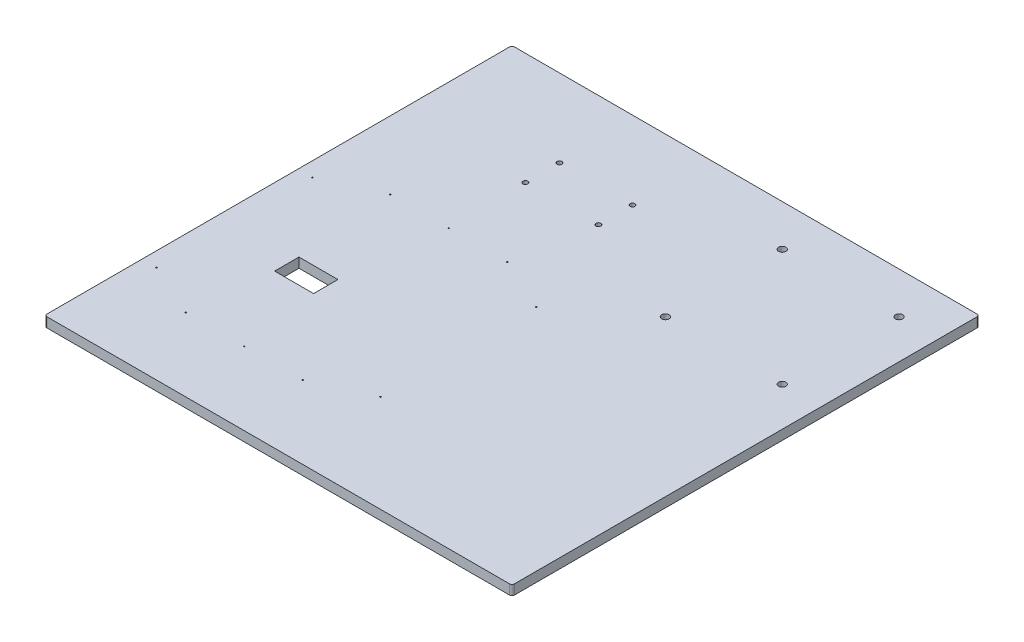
ISO-10303-21;
HEADER;
FILE_DESCRIPTION(('STEP AP214'),'2;1');
FILE_NAME('part.step','',(''),(''),'','','');
FILE_SCHEMA(('AUTOMOTIVE_DESIGN { 1 0 10303 214 1 1 1 1 }'));
ENDSEC;
DATA;
#1=APPLICATION_CONTEXT('core data for automotive mechanical design processes');
#2=APPLICATION_PROTOCOL_DEFINITION('international standard','automotive_design',2000,#1);
#3=PRODUCT_CONTEXT('',#1,'mechanical');
#4=PRODUCT('Part','Part','',(#3));
#5=PRODUCT_RELATED_PRODUCT_CATEGORY('part','',(#4));
#6=PRODUCT_DEFINITION_FORMATION('','',#4);
#7=PRODUCT_DEFINITION_CONTEXT('part definition',#1,'design');
#8=PRODUCT_DEFINITION('design','',#6,#7);
#9=PRODUCT_DEFINITION_SHAPE('','',#8);
#10=(LENGTH_UNIT() NAMED_UNIT(*) SI_UNIT(.MILLI.,.METRE.));
#11=(NAMED_UNIT(*) PLANE_ANGLE_UNIT() SI_UNIT($,.RADIAN.));
#12=(NAMED_UNIT(*) SI_UNIT($,.STERADIAN.) SOLID_ANGLE_UNIT());
#13=UNCERTAINTY_MEASURE_WITH_UNIT(LENGTH_MEASURE(1.E-05),#10,'distance_accuracy_value','');
#14=(GEOMETRIC_REPRESENTATION_CONTEXT(3) GLOBAL_UNCERTAINTY_ASSIGNED_CONTEXT((#13)) GLOBAL_UNIT_ASSIGNED_CONTEXT((#10,
#11,#12)) REPRESENTATION_CONTEXT('',''));
#15=CARTESIAN_POINT('',(0.,0.,0.));
#16=DIRECTION('',(0.,0.,1.));
#17=DIRECTION('',(1.,0.,0.));
#18=AXIS2_PLACEMENT_3D('',#15,#16,#17);
#19=CARTESIAN_POINT('',(0.,12.7,0.));
#20=DIRECTION('',(0.,-1.,0.));
#21=DIRECTION('',(0.,0.,-1.));
#22=AXIS2_PLACEMENT_3D('',#19,#20,#21);
#23=PLANE('',#22);
#24=CARTESIAN_POINT('',(258.7625,12.7,-463.55));
#25=DIRECTION('',(0.,1.,0.));
#26=DIRECTION('',(0.,0.,1.));
#27=AXIS2_PLACEMENT_3D('',#24,#25,#26);
#28=CIRCLE('',#27,3.17499999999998);
#29=CARTESIAN_POINT('',(258.7625,12.7,-460.375));
#30=VERTEX_POINT('',#29);
#31=EDGE_CURVE('E557',#30,#30,#28,.T.);
#32=ORIENTED_EDGE('',*,*,#31,.F.);
#33=EDGE_LOOP('',(#32));
#34=FACE_BOUND('',#33,.T.);
#35=CARTESIAN_POINT('',(163.5125,12.7,-463.55));
#36=DIRECTION('',(0.,1.,0.));
#37=DIRECTION('',(0.,0.,1.));
#38=AXIS2_PLACEMENT_3D('',#35,#36,#37);
#39=CIRCLE('',#38,3.17500000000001);
#40=CARTESIAN_POINT('',(163.5125,12.7,-460.375));
#41=VERTEX_POINT('',#40);
#42=EDGE_CURVE('E559',#41,#41,#39,.T.);
#43=ORIENTED_EDGE('',*,*,#42,.F.);
#44=EDGE_LOOP('',(#43));
#45=FACE_BOUND('',#44,.T.);
#46=CARTESIAN_POINT('',(163.5125,12.7,-508.));
#47=DIRECTION('',(0.,1.,0.));
#48=DIRECTION('',(0.,0.,1.));
#49=AXIS2_PLACEMENT_3D('',#46,#47,#48);
#50=CIRCLE('',#49,3.17500000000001);
#51=CARTESIAN_POINT('',(163.5125,12.7,-504.825));
#52=VERTEX_POINT('',#51);
#53=EDGE_CURVE('E567',#52,#52,#50,.T.);
#54=ORIENTED_EDGE('',*,*,#53,.F.);
#55=EDGE_LOOP('',(#54));
#56=FACE_BOUND('',#55,.T.);
#57=CARTESIAN_POINT('',(258.7625,12.7,-508.));
#58=DIRECTION('',(0.,1.,0.));
#59=DIRECTION('',(0.,0.,1.));
#60=AXIS2_PLACEMENT_3D('',#57,#58,#59);
#61=CIRCLE('',#60,3.17499999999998);
#62=CARTESIAN_POINT('',(258.7625,12.7,-504.825));
#63=VERTEX_POINT('',#62);
#64=EDGE_CURVE('E573',#63,#63,#61,.T.);
#65=ORIENTED_EDGE('',*,*,#64,.F.);
#66=EDGE_LOOP('',(#65));
#67=FACE_BOUND('',#66,.T.);
#68=CARTESIAN_POINT('',(558.8,12.7,-555.625));
#69=DIRECTION('',(0.,1.,0.));
#70=DIRECTION('',(0.,0.,1.));
#71=AXIS2_PLACEMENT_3D('',#68,#69,#70);
#72=CIRCLE('',#71,4.7625);
#73=CARTESIAN_POINT('',(558.8,12.7,-550.8625));
#74=VERTEX_POINT('',#73);
#75=EDGE_CURVE('E579',#74,#74,#72,.T.);
#76=ORIENTED_EDGE('',*,*,#75,.F.);
#77=EDGE_LOOP('',(#76));
#78=FACE_BOUND('',#77,.T.);
#79=CARTESIAN_POINT('',(558.8,12.7,-403.225));
#80=DIRECTION('',(0.,1.,0.));
#81=DIRECTION('',(0.,0.,1.));
#82=AXIS2_PLACEMENT_3D('',#79,#80,#81);
#83=CIRCLE('',#82,4.7625);
#84=CARTESIAN_POINT('',(558.8,12.7,-398.4625));
#85=VERTEX_POINT('',#84);
#86=EDGE_CURVE('E585',#85,#85,#83,.T.);
#87=ORIENTED_EDGE('',*,*,#86,.F.);
#88=EDGE_LOOP('',(#87));
#89=FACE_BOUND('',#88,.T.);
#90=CARTESIAN_POINT('',(406.4,12.7,-403.225));
#91=DIRECTION('',(0.,1.,0.));
#92=DIRECTION('',(0.,0.,1.));
#93=AXIS2_PLACEMENT_3D('',#90,#91,#92);
#94=CIRCLE('',#93,4.7625);
#95=CARTESIAN_POINT('',(406.4,12.7,-398.4625));
#96=VERTEX_POINT('',#95);
#97=EDGE_CURVE('E591',#96,#96,#94,.T.);
#98=ORIENTED_EDGE('',*,*,#97,.F.);
#99=EDGE_LOOP('',(#98));
#100=FACE_BOUND('',#99,.T.);
#101=CARTESIAN_POINT('',(406.4,12.7,-555.625));
#102=DIRECTION('',(0.,1.,0.));
#103=DIRECTION('',(0.,0.,1.));
#104=AXIS2_PLACEMENT_3D('',#101,#102,#103);
#105=CIRCLE('',#104,4.7625);
#106=CARTESIAN_POINT('',(406.4,12.7,-550.8625));
#107=VERTEX_POINT('',#106);
#108=EDGE_CURVE('E597',#107,#107,#105,.T.);
#109=ORIENTED_EDGE('',*,*,#108,.F.);
#110=EDGE_LOOP('',(#109));
#111=FACE_BOUND('',#110,.T.);
#112=CARTESIAN_POINT('',(88.9,12.7,-95.25));
#113=DIRECTION('',(0.,1.,0.));
#114=DIRECTION('',(0.,0.,1.));
#115=AXIS2_PLACEMENT_3D('',#112,#113,#114);
#116=CIRCLE('',#115,0.793749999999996);
#117=CARTESIAN_POINT('',(88.9,12.7,-94.45625));
#118=VERTEX_POINT('',#117);
#119=EDGE_CURVE('E603',#118,#118,#116,.T.);
#120=ORIENTED_EDGE('',*,*,#119,.F.);
#121=EDGE_LOOP('',(#120));
#122=FACE_BOUND('',#121,.T.);
#123=CARTESIAN_POINT('',(165.1,12.7,-95.25));
#124=DIRECTION('',(0.,1.,0.));
#125=DIRECTION('',(0.,0.,1.));
#126=AXIS2_PLACEMENT_3D('',#123,#124,#125);
#127=CIRCLE('',#126,0.79375000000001);
#128=CARTESIAN_POINT('',(165.1,12.7,-94.45625));
#129=VERTEX_POINT('',#128);
#130=EDGE_CURVE('E609',#129,#129,#127,.T.);
#131=ORIENTED_EDGE('',*,*,#130,.F.);
#132=EDGE_LOOP('',(#131));
#133=FACE_BOUND('',#132,.T.);
#134=CARTESIAN_POINT('',(241.3,12.7,-95.25));
#135=DIRECTION('',(0.,1.,0.));
#136=DIRECTION('',(0.,0.,1.));
#137=AXIS2_PLACEMENT_3D('',#134,#135,#136);
#138=CIRCLE('',#137,0.79375000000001);
#139=CARTESIAN_POINT('',(241.3,12.7,-94.45625));
#140=VERTEX_POINT('',#139);
#141=EDGE_CURVE('E615',#140,#140,#138,.T.);
#142=ORIENTED_EDGE('',*,*,#141,.F.);
#143=EDGE_LOOP('',(#142));
#144=FACE_BOUND('',#143,.T.);
#145=CARTESIAN_POINT('',(311.15,12.7,-127.));
#146=DIRECTION('',(0.,1.,0.));
#147=DIRECTION('',(0.,0.,1.));
#148=AXIS2_PLACEMENT_3D('',#145,#146,#147);
#149=CIRCLE('',#148,0.793749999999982);
#150=CARTESIAN_POINT('',(311.15,12.7,-126.20625));
#151=VERTEX_POINT('',#150);
#152=EDGE_CURVE('E621',#151,#151,#149,.T.);
#153=ORIENTED_EDGE('',*,*,#152,.F.);
#154=EDGE_LOOP('',(#153));
#155=FACE_BOUND('',#154,.T.);
#156=CARTESIAN_POINT('',(311.15,12.7,-330.2));
#157=DIRECTION('',(0.,1.,0.));
#158=DIRECTION('',(0.,0.,1.));
#159=AXIS2_PLACEMENT_3D('',#156,#157,#158);
#160=CIRCLE('',#159,0.793749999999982);
#161=CARTESIAN_POINT('',(311.15,12.7,-329.40625));
#162=VERTEX_POINT('',#161);
#163=EDGE_CURVE('E627',#162,#162,#160,.T.);
#164=ORIENTED_EDGE('',*,*,#163,.F.);
#165=EDGE_LOOP('',(#164));
#166=FACE_BOUND('',#165,.T.);
#167=CARTESIAN_POINT('',(241.3,12.7,-361.95));
#168=DIRECTION('',(0.,1.,0.));
#169=DIRECTION('',(0.,0.,1.));
#170=AXIS2_PLACEMENT_3D('',#167,#168,#169);
#171=CIRCLE('',#170,0.79375000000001);
#172=CARTESIAN_POINT('',(241.3,12.7,-361.15625));
#173=VERTEX_POINT('',#172);
#174=EDGE_CURVE('E633',#173,#173,#171,.T.);
#175=ORIENTED_EDGE('',*,*,#174,.F.);
#176=EDGE_LOOP('',(#175));
#177=FACE_BOUND('',#176,.T.);
#178=CARTESIAN_POINT('',(165.1,12.7,-361.95));
#179=DIRECTION('',(0.,1.,0.));
#180=DIRECTION('',(0.,0.,1.));
#181=AXIS2_PLACEMENT_3D('',#178,#179,#180);
#182=CIRCLE('',#181,0.79375000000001);
#183=CARTESIAN_POINT('',(165.1,12.7,-361.15625));
#184=VERTEX_POINT('',#183);
#185=EDGE_CURVE('E639',#184,#184,#182,.T.);
#186=ORIENTED_EDGE('',*,*,#185,.F.);
#187=EDGE_LOOP('',(#186));
#188=FACE_BOUND('',#187,.T.);
#189=CARTESIAN_POINT('',(88.9,12.7,-361.95));
#190=DIRECTION('',(0.,1.,0.));
#191=DIRECTION('',(0.,0.,1.));
#192=AXIS2_PLACEMENT_3D('',#189,#190,#191);
#193=CIRCLE('',#192,0.793749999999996);
#194=CARTESIAN_POINT('',(88.9,12.7,-361.15625));
#195=VERTEX_POINT('',#194);
#196=EDGE_CURVE('E645',#195,#195,#193,.T.);
#197=ORIENTED_EDGE('',*,*,#196,.F.);
#198=EDGE_LOOP('',(#197));
#199=FACE_BOUND('',#198,.T.);
#200=CARTESIAN_POINT('',(19.0499999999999,12.7,-330.2));
#201=DIRECTION('',(0.,1.,0.));
#202=DIRECTION('',(0.,0.,1.));
#203=AXIS2_PLACEMENT_3D('',#200,#201,#202);
#204=CIRCLE('',#203,0.793749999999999);
#205=CARTESIAN_POINT('',(19.0499999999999,12.7,-329.40625));
#206=VERTEX_POINT('',#205);
#207=EDGE_CURVE('E651',#206,#206,#204,.T.);
#208=ORIENTED_EDGE('',*,*,#207,.F.);
#209=EDGE_LOOP('',(#208));
#210=FACE_BOUND('',#209,.T.);
#211=CARTESIAN_POINT('',(19.05,12.7,-127.));
#212=DIRECTION('',(0.,1.,0.));
#213=DIRECTION('',(0.,0.,1.));
#214=AXIS2_PLACEMENT_3D('',#211,#212,#213);
#215=CIRCLE('',#214,0.793749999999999);
#216=CARTESIAN_POINT('',(19.05,12.7,-126.20625));
#217=VERTEX_POINT('',#216);
#218=EDGE_CURVE('E657',#217,#217,#215,.T.);
#219=ORIENTED_EDGE('',*,*,#218,.F.);
#220=EDGE_LOOP('',(#219));
#221=FACE_BOUND('',#220,.T.);
#222=DIRECTION('',(0.,0.,-1.));
#223=VECTOR('',#222,1.);
#224=CARTESIAN_POINT('',(609.6,12.7,0.));
#225=LINE('',#224,#223);
#226=CARTESIAN_POINT('',(609.6,12.7,-3.175));
#227=VERTEX_POINT('',#226);
#228=CARTESIAN_POINT('',(609.6,12.7,-606.425));
#229=VERTEX_POINT('',#228);
#230=EDGE_CURVE('E174',#227,#229,#225,.T.);
#231=ORIENTED_EDGE('',*,*,#230,.T.);
#232=CARTESIAN_POINT('',(606.425,12.7,-606.425));
#233=DIRECTION('',(0.,-1.,0.));
#234=DIRECTION('',(0.,0.,-1.));
#235=AXIS2_PLACEMENT_3D('',#232,#233,#234);
#236=CIRCLE('',#235,3.175);
#237=CARTESIAN_POINT('',(606.425,12.7,-609.6));
#238=VERTEX_POINT('',#237);
#239=EDGE_CURVE('E212',#229,#238,#236,.F.);
#240=ORIENTED_EDGE('',*,*,#239,.T.);
#241=DIRECTION('',(-1.,0.,0.));
#242=VECTOR('',#241,1.);
#243=CARTESIAN_POINT('',(0.,12.7,-609.6));
#244=LINE('',#243,#242);
#245=CARTESIAN_POINT('',(3.175,12.7,-609.6));
#246=VERTEX_POINT('',#245);
#247=EDGE_CURVE('E177',#238,#246,#244,.T.);
#248=ORIENTED_EDGE('',*,*,#247,.T.);
#249=CARTESIAN_POINT('',(3.175,12.7,-606.425));
#250=DIRECTION('',(0.,-1.,0.));
#251=DIRECTION('',(0.,0.,-1.));
#252=AXIS2_PLACEMENT_3D('',#249,#250,#251);
#253=CIRCLE('',#252,3.175);
#254=CARTESIAN_POINT('',(0.,12.7,-606.425));
#255=VERTEX_POINT('',#254);
#256=EDGE_CURVE('E207',#246,#255,#253,.F.);
#257=ORIENTED_EDGE('',*,*,#256,.T.);
#258=DIRECTION('',(0.,0.,1.));
#259=VECTOR('',#258,1.);
#260=CARTESIAN_POINT('',(0.,12.7,0.));
#261=LINE('',#260,#259);
#262=CARTESIAN_POINT('',(0.,12.7,-3.175));
#263=VERTEX_POINT('',#262);
#264=EDGE_CURVE('E169',#255,#263,#261,.T.);
#265=ORIENTED_EDGE('',*,*,#264,.T.);
#266=CARTESIAN_POINT('',(3.175,12.7,-3.175));
#267=DIRECTION('',(0.,-1.,0.));
#268=DIRECTION('',(0.,0.,-1.));
#269=AXIS2_PLACEMENT_3D('',#266,#267,#268);
#270=CIRCLE('',#269,3.175);
#271=CARTESIAN_POINT('',(3.175,12.7,0.));
#272=VERTEX_POINT('',#271);
#273=EDGE_CURVE('E57',#263,#272,#270,.F.);
#274=ORIENTED_EDGE('',*,*,#273,.T.);
#275=DIRECTION('',(1.,0.,0.));
#276=VECTOR('',#275,1.);
#277=CARTESIAN_POINT('',(0.,12.7,0.));
#278=LINE('',#277,#276);
#279=CARTESIAN_POINT('',(606.425,12.7,0.));
#280=VERTEX_POINT('',#279);
#281=EDGE_CURVE('E171',#272,#280,#278,.T.);
#282=ORIENTED_EDGE('',*,*,#281,.T.);
#283=CARTESIAN_POINT('',(606.425,12.7,-3.175));
#284=DIRECTION('',(0.,-1.,0.));
#285=DIRECTION('',(0.,0.,-1.));
#286=AXIS2_PLACEMENT_3D('',#283,#284,#285);
#287=CIRCLE('',#286,3.175);
#288=EDGE_CURVE('E210',#280,#227,#287,.F.);
#289=ORIENTED_EDGE('',*,*,#288,.T.);
#290=EDGE_LOOP('',(#231,#240,#248,#257,#265,#274,#282,#289));
#291=FACE_BOUND('',#290,.T.);
#292=DIRECTION('',(0.,0.,1.));
#293=VECTOR('',#292,1.);
#294=CARTESIAN_POINT('',(99.9977117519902,12.7,-231.774999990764));
#295=LINE('',#294,#293);
#296=CARTESIAN_POINT('',(99.9977117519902,12.7,-231.774999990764));
#297=VERTEX_POINT('',#296);
#298=CARTESIAN_POINT('',(99.9977117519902,12.7,-200.024999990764));
#299=VERTEX_POINT('',#298);
#300=EDGE_CURVE('E126',#297,#299,#295,.T.);
#301=ORIENTED_EDGE('',*,*,#300,.F.);
#302=DIRECTION('',(-1.,0.,0.));
#303=VECTOR('',#302,1.);
#304=CARTESIAN_POINT('',(99.9977117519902,12.7,-231.774999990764));
#305=LINE('',#304,#303);
#306=CARTESIAN_POINT('',(150.797705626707,12.7,-231.774999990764));
#307=VERTEX_POINT('',#306);
#308=EDGE_CURVE('E151',#307,#297,#305,.T.);
#309=ORIENTED_EDGE('',*,*,#308,.F.);
#310=DIRECTION('',(0.,0.,-1.));
#311=VECTOR('',#310,1.);
#312=CARTESIAN_POINT('',(150.797705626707,12.7,-231.774999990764));
#313=LINE('',#312,#311);
#314=CARTESIAN_POINT('',(150.797705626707,12.7,-200.024999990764));
#315=VERTEX_POINT('',#314);
#316=EDGE_CURVE('E149',#315,#307,#313,.T.);
#317=ORIENTED_EDGE('',*,*,#316,.F.);
#318=DIRECTION('',(1.,0.,0.));
#319=VECTOR('',#318,1.);
#320=CARTESIAN_POINT('',(99.9977117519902,12.7,-200.024999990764));
#321=LINE('',#320,#319);
#322=EDGE_CURVE('E136',#299,#315,#321,.T.);
#323=ORIENTED_EDGE('',*,*,#322,.F.);
#324=EDGE_LOOP('',(#301,#309,#317,#323));
#325=FACE_BOUND('',#324,.T.);
#326=ADVANCED_FACE('F35',(#34,#45,#56,#67,#78,#89,#100,#111,#122,#133,#144,#155,#166,#177,#188,
#199,#210,#221,#291,#325),#23,.F.);
#327=CARTESIAN_POINT('',(0.,0.,0.));
#328=DIRECTION('',(0.,-1.,0.));
#329=DIRECTION('',(0.,0.,-1.));
#330=AXIS2_PLACEMENT_3D('',#327,#328,#329);
#331=PLANE('',#330);
#332=CARTESIAN_POINT('',(258.7625,0.,-463.55));
#333=DIRECTION('',(0.,1.,0.));
#334=DIRECTION('',(0.,0.,1.));
#335=AXIS2_PLACEMENT_3D('',#332,#333,#334);
#336=CIRCLE('',#335,3.17499999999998);
#337=CARTESIAN_POINT('',(258.7625,0.,-460.375));
#338=VERTEX_POINT('',#337);
#339=EDGE_CURVE('E555',#338,#338,#336,.T.);
#340=ORIENTED_EDGE('',*,*,#339,.T.);
#341=EDGE_LOOP('',(#340));
#342=FACE_BOUND('',#341,.T.);
#343=CARTESIAN_POINT('',(163.5125,0.,-463.55));
#344=DIRECTION('',(0.,1.,0.));
#345=DIRECTION('',(0.,0.,1.));
#346=AXIS2_PLACEMENT_3D('',#343,#344,#345);
#347=CIRCLE('',#346,3.17499999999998);
#348=CARTESIAN_POINT('',(163.5125,0.,-460.375));
#349=VERTEX_POINT('',#348);
#350=EDGE_CURVE('E564',#349,#349,#347,.T.);
#351=ORIENTED_EDGE('',*,*,#350,.T.);
#352=EDGE_LOOP('',(#351));
#353=FACE_BOUND('',#352,.T.);
#354=CARTESIAN_POINT('',(163.5125,0.,-508.));
#355=DIRECTION('',(0.,1.,0.));
#356=DIRECTION('',(0.,0.,1.));
#357=AXIS2_PLACEMENT_3D('',#354,#355,#356);
#358=CIRCLE('',#357,3.17499999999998);
#359=CARTESIAN_POINT('',(163.5125,0.,-504.825));
#360=VERTEX_POINT('',#359);
#361=EDGE_CURVE('E570',#360,#360,#358,.T.);
#362=ORIENTED_EDGE('',*,*,#361,.T.);
#363=EDGE_LOOP('',(#362));
#364=FACE_BOUND('',#363,.T.);
#365=CARTESIAN_POINT('',(258.7625,0.,-508.));
#366=DIRECTION('',(0.,1.,0.));
#367=DIRECTION('',(0.,0.,1.));
#368=AXIS2_PLACEMENT_3D('',#365,#366,#367);
#369=CIRCLE('',#368,3.17499999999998);
#370=CARTESIAN_POINT('',(258.7625,0.,-504.825));
#371=VERTEX_POINT('',#370);
#372=EDGE_CURVE('E576',#371,#371,#369,.T.);
#373=ORIENTED_EDGE('',*,*,#372,.T.);
#374=EDGE_LOOP('',(#373));
#375=FACE_BOUND('',#374,.T.);
#376=CARTESIAN_POINT('',(558.8,0.,-555.625));
#377=DIRECTION('',(0.,1.,0.));
#378=DIRECTION('',(0.,0.,1.));
#379=AXIS2_PLACEMENT_3D('',#376,#377,#378);
#380=CIRCLE('',#379,4.7625);
#381=CARTESIAN_POINT('',(558.8,0.,-550.8625));
#382=VERTEX_POINT('',#381);
#383=EDGE_CURVE('E582',#382,#382,#380,.T.);
#384=ORIENTED_EDGE('',*,*,#383,.T.);
#385=EDGE_LOOP('',(#384));
#386=FACE_BOUND('',#385,.T.);
#387=CARTESIAN_POINT('',(558.8,0.,-403.225));
#388=DIRECTION('',(0.,1.,0.));
#389=DIRECTION('',(0.,0.,1.));
#390=AXIS2_PLACEMENT_3D('',#387,#388,#389);
#391=CIRCLE('',#390,4.7625);
#392=CARTESIAN_POINT('',(558.8,0.,-398.4625));
#393=VERTEX_POINT('',#392);
#394=EDGE_CURVE('E588',#393,#393,#391,.T.);
#395=ORIENTED_EDGE('',*,*,#394,.T.);
#396=EDGE_LOOP('',(#395));
#397=FACE_BOUND('',#396,.T.);
#398=CARTESIAN_POINT('',(406.4,0.,-403.225));
#399=DIRECTION('',(0.,1.,0.));
#400=DIRECTION('',(0.,0.,1.));
#401=AXIS2_PLACEMENT_3D('',#398,#399,#400);
#402=CIRCLE('',#401,4.7625);
#403=CARTESIAN_POINT('',(406.4,0.,-398.4625));
#404=VERTEX_POINT('',#403);
#405=EDGE_CURVE('E594',#404,#404,#402,.T.);
#406=ORIENTED_EDGE('',*,*,#405,.T.);
#407=EDGE_LOOP('',(#406));
#408=FACE_BOUND('',#407,.T.);
#409=CARTESIAN_POINT('',(406.4,0.,-555.625));
#410=DIRECTION('',(0.,1.,0.));
#411=DIRECTION('',(0.,0.,1.));
#412=AXIS2_PLACEMENT_3D('',#409,#410,#411);
#413=CIRCLE('',#412,4.7625);
#414=CARTESIAN_POINT('',(406.4,0.,-550.8625));
#415=VERTEX_POINT('',#414);
#416=EDGE_CURVE('E600',#415,#415,#413,.T.);
#417=ORIENTED_EDGE('',*,*,#416,.T.);
#418=EDGE_LOOP('',(#417));
#419=FACE_BOUND('',#418,.T.);
#420=CARTESIAN_POINT('',(88.9,0.,-95.25));
#421=DIRECTION('',(0.,1.,0.));
#422=DIRECTION('',(0.,0.,1.));
#423=AXIS2_PLACEMENT_3D('',#420,#421,#422);
#424=CIRCLE('',#423,0.793749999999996);
#425=CARTESIAN_POINT('',(88.9,0.,-94.45625));
#426=VERTEX_POINT('',#425);
#427=EDGE_CURVE('E606',#426,#426,#424,.T.);
#428=ORIENTED_EDGE('',*,*,#427,.T.);
#429=EDGE_LOOP('',(#428));
#430=FACE_BOUND('',#429,.T.);
#431=CARTESIAN_POINT('',(165.1,0.,-95.25));
#432=DIRECTION('',(0.,1.,0.));
#433=DIRECTION('',(0.,0.,1.));
#434=AXIS2_PLACEMENT_3D('',#431,#432,#433);
#435=CIRCLE('',#434,0.79375000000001);
#436=CARTESIAN_POINT('',(165.1,0.,-94.45625));
#437=VERTEX_POINT('',#436);
#438=EDGE_CURVE('E612',#437,#437,#435,.T.);
#439=ORIENTED_EDGE('',*,*,#438,.T.);
#440=EDGE_LOOP('',(#439));
#441=FACE_BOUND('',#440,.T.);
#442=CARTESIAN_POINT('',(241.3,0.,-95.25));
#443=DIRECTION('',(0.,1.,0.));
#444=DIRECTION('',(0.,0.,1.));
#445=AXIS2_PLACEMENT_3D('',#442,#443,#444);
#446=CIRCLE('',#445,0.79375000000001);
#447=CARTESIAN_POINT('',(241.3,0.,-94.45625));
#448=VERTEX_POINT('',#447);
#449=EDGE_CURVE('E618',#448,#448,#446,.T.);
#450=ORIENTED_EDGE('',*,*,#449,.T.);
#451=EDGE_LOOP('',(#450));
#452=FACE_BOUND('',#451,.T.);
#453=CARTESIAN_POINT('',(311.15,0.,-127.));
#454=DIRECTION('',(0.,1.,0.));
#455=DIRECTION('',(0.,0.,1.));
#456=AXIS2_PLACEMENT_3D('',#453,#454,#455);
#457=CIRCLE('',#456,0.793749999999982);
#458=CARTESIAN_POINT('',(311.15,0.,-126.20625));
#459=VERTEX_POINT('',#458);
#460=EDGE_CURVE('E624',#459,#459,#457,.T.);
#461=ORIENTED_EDGE('',*,*,#460,.T.);
#462=EDGE_LOOP('',(#461));
#463=FACE_BOUND('',#462,.T.);
#464=CARTESIAN_POINT('',(311.15,0.,-330.2));
#465=DIRECTION('',(0.,1.,0.));
#466=DIRECTION('',(0.,0.,1.));
#467=AXIS2_PLACEMENT_3D('',#464,#465,#466);
#468=CIRCLE('',#467,0.793749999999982);
#469=CARTESIAN_POINT('',(311.15,0.,-329.40625));
#470=VERTEX_POINT('',#469);
#471=EDGE_CURVE('E630',#470,#470,#468,.T.);
#472=ORIENTED_EDGE('',*,*,#471,.T.);
#473=EDGE_LOOP('',(#472));
#474=FACE_BOUND('',#473,.T.);
#475=CARTESIAN_POINT('',(241.3,0.,-361.95));
#476=DIRECTION('',(0.,1.,0.));
#477=DIRECTION('',(0.,0.,1.));
#478=AXIS2_PLACEMENT_3D('',#475,#476,#477);
#479=CIRCLE('',#478,0.79375000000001);
#480=CARTESIAN_POINT('',(241.3,0.,-361.15625));
#481=VERTEX_POINT('',#480);
#482=EDGE_CURVE('E636',#481,#481,#479,.T.);
#483=ORIENTED_EDGE('',*,*,#482,.T.);
#484=EDGE_LOOP('',(#483));
#485=FACE_BOUND('',#484,.T.);
#486=CARTESIAN_POINT('',(165.1,0.,-361.95));
#487=DIRECTION('',(0.,1.,0.));
#488=DIRECTION('',(0.,0.,1.));
#489=AXIS2_PLACEMENT_3D('',#486,#487,#488);
#490=CIRCLE('',#489,0.79375000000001);
#491=CARTESIAN_POINT('',(165.1,0.,-361.15625));
#492=VERTEX_POINT('',#491);
#493=EDGE_CURVE('E642',#492,#492,#490,.T.);
#494=ORIENTED_EDGE('',*,*,#493,.T.);
#495=EDGE_LOOP('',(#494));
#496=FACE_BOUND('',#495,.T.);
#497=CARTESIAN_POINT('',(88.9,0.,-361.95));
#498=DIRECTION('',(0.,1.,0.));
#499=DIRECTION('',(0.,0.,1.));
#500=AXIS2_PLACEMENT_3D('',#497,#498,#499);
#501=CIRCLE('',#500,0.793749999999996);
#502=CARTESIAN_POINT('',(88.9,0.,-361.15625));
#503=VERTEX_POINT('',#502);
#504=EDGE_CURVE('E648',#503,#503,#501,.T.);
#505=ORIENTED_EDGE('',*,*,#504,.T.);
#506=EDGE_LOOP('',(#505));
#507=FACE_BOUND('',#506,.T.);
#508=CARTESIAN_POINT('',(19.0499999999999,0.,-330.2));
#509=DIRECTION('',(0.,1.,0.));
#510=DIRECTION('',(0.,0.,1.));
#511=AXIS2_PLACEMENT_3D('',#508,#509,#510);
#512=CIRCLE('',#511,0.793749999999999);
#513=CARTESIAN_POINT('',(19.0499999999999,0.,-329.40625));
#514=VERTEX_POINT('',#513);
#515=EDGE_CURVE('E654',#514,#514,#512,.T.);
#516=ORIENTED_EDGE('',*,*,#515,.T.);
#517=EDGE_LOOP('',(#516));
#518=FACE_BOUND('',#517,.T.);
#519=CARTESIAN_POINT('',(19.05,0.,-127.));
#520=DIRECTION('',(0.,1.,0.));
#521=DIRECTION('',(0.,0.,1.));
#522=AXIS2_PLACEMENT_3D('',#519,#520,#521);
#523=CIRCLE('',#522,0.793749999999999);
#524=CARTESIAN_POINT('',(19.05,0.,-126.20625));
#525=VERTEX_POINT('',#524);
#526=EDGE_CURVE('E158',#525,#525,#523,.T.);
#527=ORIENTED_EDGE('',*,*,#526,.T.);
#528=EDGE_LOOP('',(#527));
#529=FACE_BOUND('',#528,.T.);
#530=DIRECTION('',(-1.,0.,0.));
#531=VECTOR('',#530,1.);
#532=CARTESIAN_POINT('',(0.,0.,-609.6));
#533=LINE('',#532,#531);
#534=CARTESIAN_POINT('',(606.425,0.,-609.6));
#535=VERTEX_POINT('',#534);
#536=CARTESIAN_POINT('',(3.175,0.,-609.6));
#537=VERTEX_POINT('',#536);
#538=EDGE_CURVE('E172',#535,#537,#533,.T.);
#539=ORIENTED_EDGE('',*,*,#538,.F.);
#540=CARTESIAN_POINT('',(606.425,0.,-606.425));
#541=DIRECTION('',(0.,-1.,0.));
#542=DIRECTION('',(0.,0.,-1.));
#543=AXIS2_PLACEMENT_3D('',#540,#541,#542);
#544=CIRCLE('',#543,3.175);
#545=CARTESIAN_POINT('',(609.6,0.,-606.425));
#546=VERTEX_POINT('',#545);
#547=EDGE_CURVE('E200',#535,#546,#544,.T.);
#548=ORIENTED_EDGE('',*,*,#547,.T.);
#549=DIRECTION('',(0.,0.,-1.));
#550=VECTOR('',#549,1.);
#551=CARTESIAN_POINT('',(609.6,0.,0.));
#552=LINE('',#551,#550);
#553=CARTESIAN_POINT('',(609.6,0.,-3.175));
#554=VERTEX_POINT('',#553);
#555=EDGE_CURVE('E185',#554,#546,#552,.T.);
#556=ORIENTED_EDGE('',*,*,#555,.F.);
#557=CARTESIAN_POINT('',(606.425,0.,-3.175));
#558=DIRECTION('',(0.,-1.,0.));
#559=DIRECTION('',(0.,0.,-1.));
#560=AXIS2_PLACEMENT_3D('',#557,#558,#559);
#561=CIRCLE('',#560,3.175);
#562=CARTESIAN_POINT('',(606.425,0.,0.));
#563=VERTEX_POINT('',#562);
#564=EDGE_CURVE('E198',#554,#563,#561,.T.);
#565=ORIENTED_EDGE('',*,*,#564,.T.);
#566=DIRECTION('',(1.,0.,0.));
#567=VECTOR('',#566,1.);
#568=CARTESIAN_POINT('',(0.,0.,0.));
#569=LINE('',#568,#567);
#570=CARTESIAN_POINT('',(3.175,0.,0.));
#571=VERTEX_POINT('',#570);
#572=EDGE_CURVE('E183',#571,#563,#569,.T.);
#573=ORIENTED_EDGE('',*,*,#572,.F.);
#574=CARTESIAN_POINT('',(3.175,0.,-3.175));
#575=DIRECTION('',(0.,-1.,0.));
#576=DIRECTION('',(0.,0.,-1.));
#577=AXIS2_PLACEMENT_3D('',#574,#575,#576);
#578=CIRCLE('',#577,3.175);
#579=CARTESIAN_POINT('',(0.,0.,-3.175));
#580=VERTEX_POINT('',#579);
#581=EDGE_CURVE('E196',#571,#580,#578,.T.);
#582=ORIENTED_EDGE('',*,*,#581,.T.);
#583=DIRECTION('',(0.,0.,1.));
#584=VECTOR('',#583,1.);
#585=CARTESIAN_POINT('',(0.,0.,0.));
#586=LINE('',#585,#584);
#587=CARTESIAN_POINT('',(0.,0.,-606.425));
#588=VERTEX_POINT('',#587);
#589=EDGE_CURVE('E144',#588,#580,#586,.T.);
#590=ORIENTED_EDGE('',*,*,#589,.F.);
#591=CARTESIAN_POINT('',(3.175,0.,-606.425));
#592=DIRECTION('',(0.,-1.,0.));
#593=DIRECTION('',(0.,0.,-1.));
#594=AXIS2_PLACEMENT_3D('',#591,#592,#593);
#595=CIRCLE('',#594,3.175);
#596=EDGE_CURVE('E194',#588,#537,#595,.T.);
#597=ORIENTED_EDGE('',*,*,#596,.T.);
#598=EDGE_LOOP('',(#539,#548,#556,#565,#573,#582,#590,#597));
#599=FACE_BOUND('',#598,.T.);
#600=DIRECTION('',(-1.,0.,0.));
#601=VECTOR('',#600,1.);
#602=CARTESIAN_POINT('',(99.9977117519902,0.,-231.774999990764));
#603=LINE('',#602,#601);
#604=CARTESIAN_POINT('',(150.797705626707,0.,-231.774999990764));
#605=VERTEX_POINT('',#604);
#606=CARTESIAN_POINT('',(99.9977117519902,0.,-231.774999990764));
#607=VERTEX_POINT('',#606);
#608=EDGE_CURVE('E137',#605,#607,#603,.T.);
#609=ORIENTED_EDGE('',*,*,#608,.T.);
#610=DIRECTION('',(0.,0.,1.));
#611=VECTOR('',#610,1.);
#612=CARTESIAN_POINT('',(99.9977117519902,0.,-231.774999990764));
#613=LINE('',#612,#611);
#614=CARTESIAN_POINT('',(99.9977117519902,0.,-200.024999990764));
#615=VERTEX_POINT('',#614);
#616=EDGE_CURVE('E156',#607,#615,#613,.T.);
#617=ORIENTED_EDGE('',*,*,#616,.T.);
#618=DIRECTION('',(1.,0.,0.));
#619=VECTOR('',#618,1.);
#620=CARTESIAN_POINT('',(99.9977117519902,0.,-200.024999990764));
#621=LINE('',#620,#619);
#622=CARTESIAN_POINT('',(150.797705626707,0.,-200.024999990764));
#623=VERTEX_POINT('',#622);
#624=EDGE_CURVE('E143',#615,#623,#621,.T.);
#625=ORIENTED_EDGE('',*,*,#624,.T.);
#626=DIRECTION('',(0.,0.,-1.));
#627=VECTOR('',#626,1.);
#628=CARTESIAN_POINT('',(150.797705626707,0.,-231.774999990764));
#629=LINE('',#628,#627);
#630=EDGE_CURVE('E160',#623,#605,#629,.T.);
#631=ORIENTED_EDGE('',*,*,#630,.T.);
#632=EDGE_LOOP('',(#609,#617,#625,#631));
#633=FACE_BOUND('',#632,.T.);
#634=ADVANCED_FACE('F228',(#342,#353,#364,#375,#386,#397,#408,#419,#430,#441,#452,#463,#474,
#485,#496,#507,#518,#529,#599,#633),#331,.T.);
#635=CARTESIAN_POINT('',(0.,12.7,0.));
#636=DIRECTION('',(1.,0.,0.));
#637=DIRECTION('',(0.,0.,-1.));
#638=AXIS2_PLACEMENT_3D('',#635,#636,#637);
#639=PLANE('',#638);
#640=ORIENTED_EDGE('',*,*,#589,.T.);
#641=DIRECTION('',(0.,-1.,0.));
#642=VECTOR('',#641,1.);
#643=CARTESIAN_POINT('',(0.,12.7,-3.175));
#644=LINE('',#643,#642);
#645=EDGE_CURVE('E11',#580,#263,#644,.F.);
#646=ORIENTED_EDGE('',*,*,#645,.T.);
#647=ORIENTED_EDGE('',*,*,#264,.F.);
#648=DIRECTION('',(0.,-1.,0.));
#649=VECTOR('',#648,1.);
#650=CARTESIAN_POINT('',(0.,12.7,-606.425));
#651=LINE('',#650,#649);
#652=EDGE_CURVE('E43',#255,#588,#651,.T.);
#653=ORIENTED_EDGE('',*,*,#652,.T.);
#654=EDGE_LOOP('',(#640,#646,#647,#653));
#655=FACE_BOUND('',#654,.T.);
#656=ADVANCED_FACE('F222',(#655),#639,.F.);
#657=CARTESIAN_POINT('',(0.,12.7,0.));
#658=DIRECTION('',(0.,0.,-1.));
#659=DIRECTION('',(-1.,0.,0.));
#660=AXIS2_PLACEMENT_3D('',#657,#658,#659);
#661=PLANE('',#660);
#662=ORIENTED_EDGE('',*,*,#572,.T.);
#663=DIRECTION('',(0.,-1.,0.));
#664=VECTOR('',#663,1.);
#665=CARTESIAN_POINT('',(606.425,12.7,0.));
#666=LINE('',#665,#664);
#667=EDGE_CURVE('E50',#563,#280,#666,.F.);
#668=ORIENTED_EDGE('',*,*,#667,.T.);
#669=ORIENTED_EDGE('',*,*,#281,.F.);
#670=DIRECTION('',(0.,-1.,0.));
#671=VECTOR('',#670,1.);
#672=CARTESIAN_POINT('',(3.175,12.7,0.));
#673=LINE('',#672,#671);
#674=EDGE_CURVE('E214',#272,#571,#673,.T.);
#675=ORIENTED_EDGE('',*,*,#674,.T.);
#676=EDGE_LOOP('',(#662,#668,#669,#675));
#677=FACE_BOUND('',#676,.T.);
#678=ADVANCED_FACE('F234',(#677),#661,.F.);
#679=CARTESIAN_POINT('',(609.6,12.7,0.));
#680=DIRECTION('',(-1.,0.,0.));
#681=DIRECTION('',(0.,0.,1.));
#682=AXIS2_PLACEMENT_3D('',#679,#680,#681);
#683=PLANE('',#682);
#684=ORIENTED_EDGE('',*,*,#555,.T.);
#685=DIRECTION('',(0.,-1.,0.));
#686=VECTOR('',#685,1.);
#687=CARTESIAN_POINT('',(609.6,12.7,-606.425));
#688=LINE('',#687,#686);
#689=EDGE_CURVE('E205',#546,#229,#688,.F.);
#690=ORIENTED_EDGE('',*,*,#689,.T.);
#691=ORIENTED_EDGE('',*,*,#230,.F.);
#692=DIRECTION('',(0.,-1.,0.));
#693=VECTOR('',#692,1.);
#694=CARTESIAN_POINT('',(609.6,12.7,-3.175));
#695=LINE('',#694,#693);
#696=EDGE_CURVE('E202',#227,#554,#695,.T.);
#697=ORIENTED_EDGE('',*,*,#696,.T.);
#698=EDGE_LOOP('',(#684,#690,#691,#697));
#699=FACE_BOUND('',#698,.T.);
#700=ADVANCED_FACE('F242',(#699),#683,.F.);
#701=CARTESIAN_POINT('',(0.,12.7,-609.6));
#702=DIRECTION('',(0.,0.,1.));
#703=DIRECTION('',(1.,0.,0.));
#704=AXIS2_PLACEMENT_3D('',#701,#702,#703);
#705=PLANE('',#704);
#706=ORIENTED_EDGE('',*,*,#247,.F.);
#707=DIRECTION('',(0.,-1.,0.));
#708=VECTOR('',#707,1.);
#709=CARTESIAN_POINT('',(606.425,12.7,-609.6));
#710=LINE('',#709,#708);
#711=EDGE_CURVE('E191',#238,#535,#710,.T.);
#712=ORIENTED_EDGE('',*,*,#711,.T.);
#713=ORIENTED_EDGE('',*,*,#538,.T.);
#714=DIRECTION('',(0.,-1.,0.));
#715=VECTOR('',#714,1.);
#716=CARTESIAN_POINT('',(3.175,12.7,-609.6));
#717=LINE('',#716,#715);
#718=EDGE_CURVE('E180',#537,#246,#717,.F.);
#719=ORIENTED_EDGE('',*,*,#718,.T.);
#720=EDGE_LOOP('',(#706,#712,#713,#719));
#721=FACE_BOUND('',#720,.T.);
#722=ADVANCED_FACE('F250',(#721),#705,.F.);
#723=CARTESIAN_POINT('',(99.9977117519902,12.7,-231.774999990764));
#724=DIRECTION('',(1.,0.,0.));
#725=DIRECTION('',(0.,0.,-1.));
#726=AXIS2_PLACEMENT_3D('',#723,#724,#725);
#727=PLANE('',#726);
#728=ORIENTED_EDGE('',*,*,#616,.F.);
#729=DIRECTION('',(0.,-1.,0.));
#730=VECTOR('',#729,1.);
#731=CARTESIAN_POINT('',(99.9977117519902,12.7,-231.774999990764));
#732=LINE('',#731,#730);
#733=EDGE_CURVE('E132',#297,#607,#732,.T.);
#734=ORIENTED_EDGE('',*,*,#733,.F.);
#735=ORIENTED_EDGE('',*,*,#300,.T.);
#736=DIRECTION('',(0.,-1.,0.));
#737=VECTOR('',#736,1.);
#738=CARTESIAN_POINT('',(99.9977117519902,12.7,-200.024999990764));
#739=LINE('',#738,#737);
#740=EDGE_CURVE('E129',#299,#615,#739,.T.);
#741=ORIENTED_EDGE('',*,*,#740,.T.);
#742=EDGE_LOOP('',(#728,#734,#735,#741));
#743=FACE_BOUND('',#742,.T.);
#744=ADVANCED_FACE('F128',(#743),#727,.T.);
#745=CARTESIAN_POINT('',(99.9977117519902,12.7,-200.024999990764));
#746=DIRECTION('',(0.,0.,-1.));
#747=DIRECTION('',(-1.,0.,0.));
#748=AXIS2_PLACEMENT_3D('',#745,#746,#747);
#749=PLANE('',#748);
#750=ORIENTED_EDGE('',*,*,#624,.F.);
#751=ORIENTED_EDGE('',*,*,#740,.F.);
#752=ORIENTED_EDGE('',*,*,#322,.T.);
#753=DIRECTION('',(0.,-1.,0.));
#754=VECTOR('',#753,1.);
#755=CARTESIAN_POINT('',(150.797705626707,12.7,-200.024999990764));
#756=LINE('',#755,#754);
#757=EDGE_CURVE('E145',#315,#623,#756,.T.);
#758=ORIENTED_EDGE('',*,*,#757,.T.);
#759=EDGE_LOOP('',(#750,#751,#752,#758));
#760=FACE_BOUND('',#759,.T.);
#761=ADVANCED_FACE('F140',(#760),#749,.T.);
#762=CARTESIAN_POINT('',(150.797705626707,12.7,-231.774999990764));
#763=DIRECTION('',(-1.,0.,0.));
#764=DIRECTION('',(0.,0.,1.));
#765=AXIS2_PLACEMENT_3D('',#762,#763,#764);
#766=PLANE('',#765);
#767=ORIENTED_EDGE('',*,*,#630,.F.);
#768=ORIENTED_EDGE('',*,*,#757,.F.);
#769=ORIENTED_EDGE('',*,*,#316,.T.);
#770=DIRECTION('',(0.,-1.,0.));
#771=VECTOR('',#770,1.);
#772=CARTESIAN_POINT('',(150.797705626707,12.7,-231.774999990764));
#773=LINE('',#772,#771);
#774=EDGE_CURVE('E166',#307,#605,#773,.T.);
#775=ORIENTED_EDGE('',*,*,#774,.T.);
#776=EDGE_LOOP('',(#767,#768,#769,#775));
#777=FACE_BOUND('',#776,.T.);
#778=ADVANCED_FACE('F493',(#777),#766,.T.);
#779=CARTESIAN_POINT('',(99.9977117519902,12.7,-231.774999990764));
#780=DIRECTION('',(0.,0.,1.));
#781=DIRECTION('',(1.,0.,0.));
#782=AXIS2_PLACEMENT_3D('',#779,#780,#781);
#783=PLANE('',#782);
#784=ORIENTED_EDGE('',*,*,#608,.F.);
#785=ORIENTED_EDGE('',*,*,#774,.F.);
#786=ORIENTED_EDGE('',*,*,#308,.T.);
#787=ORIENTED_EDGE('',*,*,#733,.T.);
#788=EDGE_LOOP('',(#784,#785,#786,#787));
#789=FACE_BOUND('',#788,.T.);
#790=ADVANCED_FACE('F284',(#789),#783,.T.);
#791=CARTESIAN_POINT('',(606.425,12.7,-606.425));
#792=DIRECTION('',(0.,-1.,0.));
#793=DIRECTION('',(0.,0.,-1.));
#794=AXIS2_PLACEMENT_3D('',#791,#792,#793);
#795=CYLINDRICAL_SURFACE('',#794,3.175);
#796=ORIENTED_EDGE('',*,*,#239,.F.);
#797=ORIENTED_EDGE('',*,*,#689,.F.);
#798=ORIENTED_EDGE('',*,*,#547,.F.);
#799=ORIENTED_EDGE('',*,*,#711,.F.);
#800=EDGE_LOOP('',(#796,#797,#798,#799));
#801=FACE_BOUND('',#800,.T.);
#802=ADVANCED_FACE('F247',(#801),#795,.T.);
#803=CARTESIAN_POINT('',(606.425,12.7,-3.175));
#804=DIRECTION('',(0.,-1.,0.));
#805=DIRECTION('',(0.,0.,-1.));
#806=AXIS2_PLACEMENT_3D('',#803,#804,#805);
#807=CYLINDRICAL_SURFACE('',#806,3.175);
#808=ORIENTED_EDGE('',*,*,#288,.F.);
#809=ORIENTED_EDGE('',*,*,#667,.F.);
#810=ORIENTED_EDGE('',*,*,#564,.F.);
#811=ORIENTED_EDGE('',*,*,#696,.F.);
#812=EDGE_LOOP('',(#808,#809,#810,#811));
#813=FACE_BOUND('',#812,.T.);
#814=ADVANCED_FACE('F239',(#813),#807,.T.);
#815=CARTESIAN_POINT('',(3.175,12.7,-3.175));
#816=DIRECTION('',(0.,-1.,0.));
#817=DIRECTION('',(0.,0.,-1.));
#818=AXIS2_PLACEMENT_3D('',#815,#816,#817);
#819=CYLINDRICAL_SURFACE('',#818,3.175);
#820=ORIENTED_EDGE('',*,*,#273,.F.);
#821=ORIENTED_EDGE('',*,*,#645,.F.);
#822=ORIENTED_EDGE('',*,*,#581,.F.);
#823=ORIENTED_EDGE('',*,*,#674,.F.);
#824=EDGE_LOOP('',(#820,#821,#822,#823));
#825=FACE_BOUND('',#824,.T.);
#826=ADVANCED_FACE('F233',(#825),#819,.T.);
#827=CARTESIAN_POINT('',(3.175,12.7,-606.425));
#828=DIRECTION('',(0.,-1.,0.));
#829=DIRECTION('',(0.,0.,-1.));
#830=AXIS2_PLACEMENT_3D('',#827,#828,#829);
#831=CYLINDRICAL_SURFACE('',#830,3.175);
#832=ORIENTED_EDGE('',*,*,#256,.F.);
#833=ORIENTED_EDGE('',*,*,#718,.F.);
#834=ORIENTED_EDGE('',*,*,#596,.F.);
#835=ORIENTED_EDGE('',*,*,#652,.F.);
#836=EDGE_LOOP('',(#832,#833,#834,#835));
#837=FACE_BOUND('',#836,.T.);
#838=ADVANCED_FACE('F37',(#837),#831,.T.);
#839=CARTESIAN_POINT('',(19.05,12.7,-127.));
#840=DIRECTION('',(0.,1.,0.));
#841=DIRECTION('',(0.,0.,1.));
#842=AXIS2_PLACEMENT_3D('',#839,#840,#841);
#843=CYLINDRICAL_SURFACE('',#842,0.793749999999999);
#844=ORIENTED_EDGE('',*,*,#526,.F.);
#845=EDGE_LOOP('',(#844));
#846=FACE_BOUND('',#845,.T.);
#847=ORIENTED_EDGE('',*,*,#218,.T.);
#848=EDGE_LOOP('',(#847));
#849=FACE_BOUND('',#848,.T.);
#850=ADVANCED_FACE('F253',(#846,#849),#843,.F.);
#851=CARTESIAN_POINT('',(19.0499999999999,12.7,-330.2));
#852=DIRECTION('',(0.,1.,0.));
#853=DIRECTION('',(0.,0.,1.));
#854=AXIS2_PLACEMENT_3D('',#851,#852,#853);
#855=CYLINDRICAL_SURFACE('',#854,0.793749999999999);
#856=ORIENTED_EDGE('',*,*,#515,.F.);
#857=EDGE_LOOP('',(#856));
#858=FACE_BOUND('',#857,.T.);
#859=ORIENTED_EDGE('',*,*,#207,.T.);
#860=EDGE_LOOP('',(#859));
#861=FACE_BOUND('',#860,.T.);
#862=ADVANCED_FACE('F258',(#858,#861),#855,.F.);
#863=CARTESIAN_POINT('',(88.9,12.7,-361.95));
#864=DIRECTION('',(0.,1.,0.));
#865=DIRECTION('',(0.,0.,1.));
#866=AXIS2_PLACEMENT_3D('',#863,#864,#865);
#867=CYLINDRICAL_SURFACE('',#866,0.793749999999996);
#868=ORIENTED_EDGE('',*,*,#504,.F.);
#869=EDGE_LOOP('',(#868));
#870=FACE_BOUND('',#869,.T.);
#871=ORIENTED_EDGE('',*,*,#196,.T.);
#872=EDGE_LOOP('',(#871));
#873=FACE_BOUND('',#872,.T.);
#874=ADVANCED_FACE('F314',(#870,#873),#867,.F.);
#875=CARTESIAN_POINT('',(165.1,12.7,-361.95));
#876=DIRECTION('',(0.,1.,0.));
#877=DIRECTION('',(0.,0.,1.));
#878=AXIS2_PLACEMENT_3D('',#875,#876,#877);
#879=CYLINDRICAL_SURFACE('',#878,0.79375000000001);
#880=ORIENTED_EDGE('',*,*,#493,.F.);
#881=EDGE_LOOP('',(#880));
#882=FACE_BOUND('',#881,.T.);
#883=ORIENTED_EDGE('',*,*,#185,.T.);
#884=EDGE_LOOP('',(#883));
#885=FACE_BOUND('',#884,.T.);
#886=ADVANCED_FACE('F324',(#882,#885),#879,.F.);
#887=CARTESIAN_POINT('',(241.3,12.7,-361.95));
#888=DIRECTION('',(0.,1.,0.));
#889=DIRECTION('',(0.,0.,1.));
#890=AXIS2_PLACEMENT_3D('',#887,#888,#889);
#891=CYLINDRICAL_SURFACE('',#890,0.79375000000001);
#892=ORIENTED_EDGE('',*,*,#482,.F.);
#893=EDGE_LOOP('',(#892));
#894=FACE_BOUND('',#893,.T.);
#895=ORIENTED_EDGE('',*,*,#174,.T.);
#896=EDGE_LOOP('',(#895));
#897=FACE_BOUND('',#896,.T.);
#898=ADVANCED_FACE('F334',(#894,#897),#891,.F.);
#899=CARTESIAN_POINT('',(311.15,12.7,-330.2));
#900=DIRECTION('',(0.,1.,0.));
#901=DIRECTION('',(0.,0.,1.));
#902=AXIS2_PLACEMENT_3D('',#899,#900,#901);
#903=CYLINDRICAL_SURFACE('',#902,0.793749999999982);
#904=ORIENTED_EDGE('',*,*,#471,.F.);
#905=EDGE_LOOP('',(#904));
#906=FACE_BOUND('',#905,.T.);
#907=ORIENTED_EDGE('',*,*,#163,.T.);
#908=EDGE_LOOP('',(#907));
#909=FACE_BOUND('',#908,.T.);
#910=ADVANCED_FACE('F344',(#906,#909),#903,.F.);
#911=CARTESIAN_POINT('',(311.15,12.7,-127.));
#912=DIRECTION('',(0.,1.,0.));
#913=DIRECTION('',(0.,0.,1.));
#914=AXIS2_PLACEMENT_3D('',#911,#912,#913);
#915=CYLINDRICAL_SURFACE('',#914,0.793749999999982);
#916=ORIENTED_EDGE('',*,*,#460,.F.);
#917=EDGE_LOOP('',(#916));
#918=FACE_BOUND('',#917,.T.);
#919=ORIENTED_EDGE('',*,*,#152,.T.);
#920=EDGE_LOOP('',(#919));
#921=FACE_BOUND('',#920,.T.);
#922=ADVANCED_FACE('F354',(#918,#921),#915,.F.);
#923=CARTESIAN_POINT('',(241.3,12.7,-95.25));
#924=DIRECTION('',(0.,1.,0.));
#925=DIRECTION('',(0.,0.,1.));
#926=AXIS2_PLACEMENT_3D('',#923,#924,#925);
#927=CYLINDRICAL_SURFACE('',#926,0.79375000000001);
#928=ORIENTED_EDGE('',*,*,#449,.F.);
#929=EDGE_LOOP('',(#928));
#930=FACE_BOUND('',#929,.T.);
#931=ORIENTED_EDGE('',*,*,#141,.T.);
#932=EDGE_LOOP('',(#931));
#933=FACE_BOUND('',#932,.T.);
#934=ADVANCED_FACE('F364',(#930,#933),#927,.F.);
#935=CARTESIAN_POINT('',(165.1,12.7,-95.25));
#936=DIRECTION('',(0.,1.,0.));
#937=DIRECTION('',(0.,0.,1.));
#938=AXIS2_PLACEMENT_3D('',#935,#936,#937);
#939=CYLINDRICAL_SURFACE('',#938,0.79375000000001);
#940=ORIENTED_EDGE('',*,*,#438,.F.);
#941=EDGE_LOOP('',(#940));
#942=FACE_BOUND('',#941,.T.);
#943=ORIENTED_EDGE('',*,*,#130,.T.);
#944=EDGE_LOOP('',(#943));
#945=FACE_BOUND('',#944,.T.);
#946=ADVANCED_FACE('F374',(#942,#945),#939,.F.);
#947=CARTESIAN_POINT('',(88.9,12.7,-95.25));
#948=DIRECTION('',(0.,1.,0.));
#949=DIRECTION('',(0.,0.,1.));
#950=AXIS2_PLACEMENT_3D('',#947,#948,#949);
#951=CYLINDRICAL_SURFACE('',#950,0.793749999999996);
#952=ORIENTED_EDGE('',*,*,#427,.F.);
#953=EDGE_LOOP('',(#952));
#954=FACE_BOUND('',#953,.T.);
#955=ORIENTED_EDGE('',*,*,#119,.T.);
#956=EDGE_LOOP('',(#955));
#957=FACE_BOUND('',#956,.T.);
#958=ADVANCED_FACE('F384',(#954,#957),#951,.F.);
#959=CARTESIAN_POINT('',(406.4,12.7,-555.625));
#960=DIRECTION('',(0.,1.,0.));
#961=DIRECTION('',(0.,0.,1.));
#962=AXIS2_PLACEMENT_3D('',#959,#960,#961);
#963=CYLINDRICAL_SURFACE('',#962,4.7625);
#964=ORIENTED_EDGE('',*,*,#416,.F.);
#965=EDGE_LOOP('',(#964));
#966=FACE_BOUND('',#965,.T.);
#967=ORIENTED_EDGE('',*,*,#108,.T.);
#968=EDGE_LOOP('',(#967));
#969=FACE_BOUND('',#968,.T.);
#970=ADVANCED_FACE('F394',(#966,#969),#963,.F.);
#971=CARTESIAN_POINT('',(406.4,12.7,-403.225));
#972=DIRECTION('',(0.,1.,0.));
#973=DIRECTION('',(0.,0.,1.));
#974=AXIS2_PLACEMENT_3D('',#971,#972,#973);
#975=CYLINDRICAL_SURFACE('',#974,4.7625);
#976=ORIENTED_EDGE('',*,*,#405,.F.);
#977=EDGE_LOOP('',(#976));
#978=FACE_BOUND('',#977,.T.);
#979=ORIENTED_EDGE('',*,*,#97,.T.);
#980=EDGE_LOOP('',(#979));
#981=FACE_BOUND('',#980,.T.);
#982=ADVANCED_FACE('F404',(#978,#981),#975,.F.);
#983=CARTESIAN_POINT('',(558.8,12.7,-403.225));
#984=DIRECTION('',(0.,1.,0.));
#985=DIRECTION('',(0.,0.,1.));
#986=AXIS2_PLACEMENT_3D('',#983,#984,#985);
#987=CYLINDRICAL_SURFACE('',#986,4.7625);
#988=ORIENTED_EDGE('',*,*,#394,.F.);
#989=EDGE_LOOP('',(#988));
#990=FACE_BOUND('',#989,.T.);
#991=ORIENTED_EDGE('',*,*,#86,.T.);
#992=EDGE_LOOP('',(#991));
#993=FACE_BOUND('',#992,.T.);
#994=ADVANCED_FACE('F414',(#990,#993),#987,.F.);
#995=CARTESIAN_POINT('',(558.8,12.7,-555.625));
#996=DIRECTION('',(0.,1.,0.));
#997=DIRECTION('',(0.,0.,1.));
#998=AXIS2_PLACEMENT_3D('',#995,#996,#997);
#999=CYLINDRICAL_SURFACE('',#998,4.7625);
#1000=ORIENTED_EDGE('',*,*,#383,.F.);
#1001=EDGE_LOOP('',(#1000));
#1002=FACE_BOUND('',#1001,.T.);
#1003=ORIENTED_EDGE('',*,*,#75,.T.);
#1004=EDGE_LOOP('',(#1003));
#1005=FACE_BOUND('',#1004,.T.);
#1006=ADVANCED_FACE('F424',(#1002,#1005),#999,.F.);
#1007=CARTESIAN_POINT('',(258.7625,12.7,-508.));
#1008=DIRECTION('',(0.,1.,0.));
#1009=DIRECTION('',(0.,0.,1.));
#1010=AXIS2_PLACEMENT_3D('',#1007,#1008,#1009);
#1011=CYLINDRICAL_SURFACE('',#1010,3.17499999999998);
#1012=ORIENTED_EDGE('',*,*,#372,.F.);
#1013=EDGE_LOOP('',(#1012));
#1014=FACE_BOUND('',#1013,.T.);
#1015=ORIENTED_EDGE('',*,*,#64,.T.);
#1016=EDGE_LOOP('',(#1015));
#1017=FACE_BOUND('',#1016,.T.);
#1018=ADVANCED_FACE('F433',(#1014,#1017),#1011,.F.);
#1019=CARTESIAN_POINT('',(163.5125,12.7,-508.));
#1020=DIRECTION('',(0.,1.,0.));
#1021=DIRECTION('',(0.,0.,1.));
#1022=AXIS2_PLACEMENT_3D('',#1019,#1020,#1021);
#1023=CYLINDRICAL_SURFACE('',#1022,3.175);
#1024=ORIENTED_EDGE('',*,*,#361,.F.);
#1025=EDGE_LOOP('',(#1024));
#1026=FACE_BOUND('',#1025,.T.);
#1027=ORIENTED_EDGE('',*,*,#53,.T.);
#1028=EDGE_LOOP('',(#1027));
#1029=FACE_BOUND('',#1028,.T.);
#1030=ADVANCED_FACE('F455',(#1026,#1029),#1023,.F.);
#1031=CARTESIAN_POINT('',(163.5125,12.7,-463.55));
#1032=DIRECTION('',(0.,1.,0.));
#1033=DIRECTION('',(0.,0.,1.));
#1034=AXIS2_PLACEMENT_3D('',#1031,#1032,#1033);
#1035=CYLINDRICAL_SURFACE('',#1034,3.175);
#1036=ORIENTED_EDGE('',*,*,#350,.F.);
#1037=EDGE_LOOP('',(#1036));
#1038=FACE_BOUND('',#1037,.T.);
#1039=ORIENTED_EDGE('',*,*,#42,.T.);
#1040=EDGE_LOOP('',(#1039));
#1041=FACE_BOUND('',#1040,.T.);
#1042=ADVANCED_FACE('F465',(#1038,#1041),#1035,.F.);
#1043=CARTESIAN_POINT('',(258.7625,12.7,-463.55));
#1044=DIRECTION('',(0.,1.,0.));
#1045=DIRECTION('',(0.,0.,1.));
#1046=AXIS2_PLACEMENT_3D('',#1043,#1044,#1045);
#1047=CYLINDRICAL_SURFACE('',#1046,3.17499999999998);
#1048=ORIENTED_EDGE('',*,*,#339,.F.);
#1049=EDGE_LOOP('',(#1048));
#1050=FACE_BOUND('',#1049,.T.);
#1051=ORIENTED_EDGE('',*,*,#31,.T.);
#1052=EDGE_LOOP('',(#1051));
#1053=FACE_BOUND('',#1052,.T.);
#1054=ADVANCED_FACE('F475',(#1050,#1053),#1047,.F.);
#1055=CLOSED_SHELL('',(#326,#634,#656,#678,#700,#722,#744,#761,#778,#790,#802,#814,#826,#838,
#850,#862,#874,#886,#898,#910,#922,#934,#946,#958,#970,#982,#994,#1006,#1018,#1030,#1042,#1054));
#1056=MANIFOLD_SOLID_BREP('B2',#1055);
#1057=ADVANCED_BREP_SHAPE_REPRESENTATION('',(#18,#1056),#14);
#1058=SHAPE_DEFINITION_REPRESENTATION(#9,#1057);
ENDSEC;
END-ISO-10303-21;
